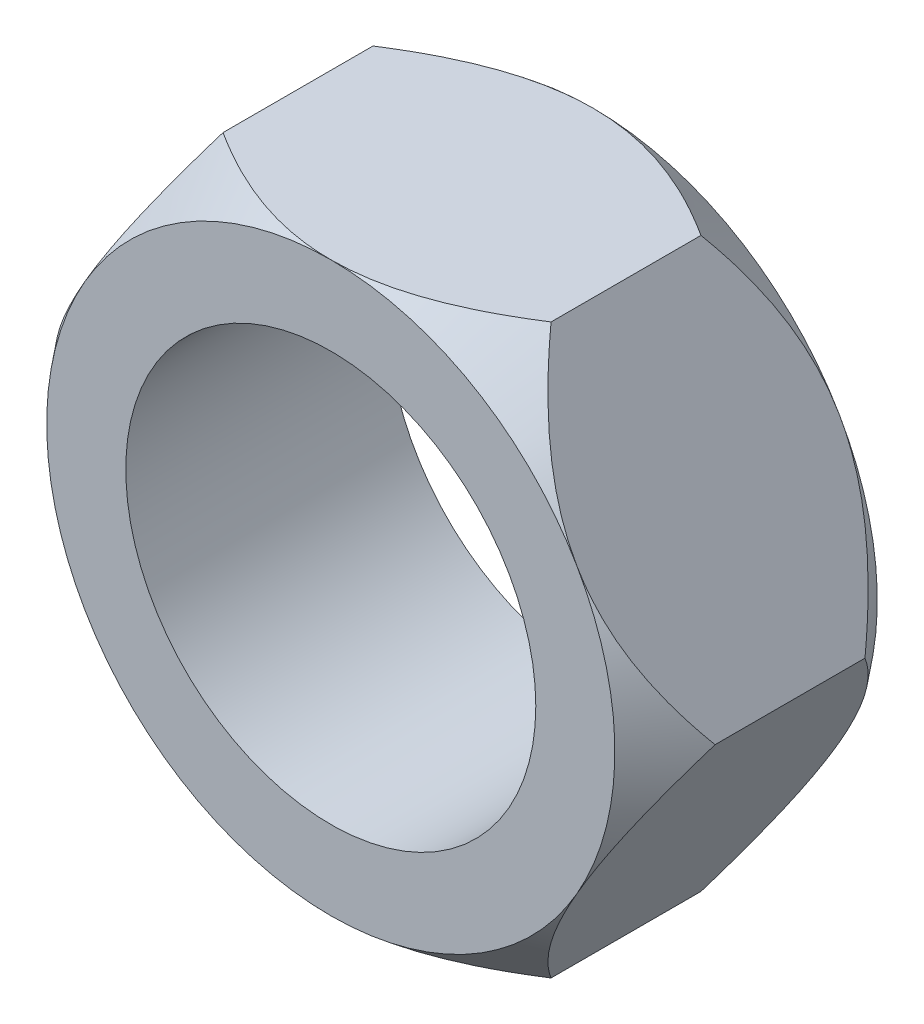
ISO-10303-21;
HEADER;
FILE_DESCRIPTION(('STEP AP214'),'2;1');
FILE_NAME('part.step','',(''),(''),'','','');
FILE_SCHEMA(('AUTOMOTIVE_DESIGN { 1 0 10303 214 1 1 1 1 }'));
ENDSEC;
DATA;
#1=APPLICATION_CONTEXT('core data for automotive mechanical design processes');
#2=APPLICATION_PROTOCOL_DEFINITION('international standard','automotive_design',2000,#1);
#3=PRODUCT_CONTEXT('',#1,'mechanical');
#4=PRODUCT('Part','Part','',(#3));
#5=PRODUCT_RELATED_PRODUCT_CATEGORY('part','',(#4));
#6=PRODUCT_DEFINITION_FORMATION('','',#4);
#7=PRODUCT_DEFINITION_CONTEXT('part definition',#1,'design');
#8=PRODUCT_DEFINITION('design','',#6,#7);
#9=PRODUCT_DEFINITION_SHAPE('','',#8);
#10=(LENGTH_UNIT() NAMED_UNIT(*) SI_UNIT(.MILLI.,.METRE.));
#11=(NAMED_UNIT(*) PLANE_ANGLE_UNIT() SI_UNIT($,.RADIAN.));
#12=(NAMED_UNIT(*) SI_UNIT($,.STERADIAN.) SOLID_ANGLE_UNIT());
#13=UNCERTAINTY_MEASURE_WITH_UNIT(LENGTH_MEASURE(1.E-05),#10,'distance_accuracy_value','');
#14=(GEOMETRIC_REPRESENTATION_CONTEXT(3) GLOBAL_UNCERTAINTY_ASSIGNED_CONTEXT((#13)) GLOBAL_UNIT_ASSIGNED_CONTEXT((#10,
#11,#12)) REPRESENTATION_CONTEXT('',''));
#15=CARTESIAN_POINT('',(0.,0.,0.));
#16=DIRECTION('',(0.,0.,1.));
#17=DIRECTION('',(1.,0.,0.));
#18=AXIS2_PLACEMENT_3D('',#15,#16,#17);
#19=CARTESIAN_POINT('',(0.,0.,-2.032));
#20=DIRECTION('',(0.,0.,1.));
#21=DIRECTION('',(1.,0.,0.));
#22=AXIS2_PLACEMENT_3D('',#19,#20,#21);
#23=PLANE('',#22);
#24=CARTESIAN_POINT('',(0.,0.,-2.032));
#25=DIRECTION('',(0.,0.,1.));
#26=DIRECTION('',(1.,0.,0.));
#27=AXIS2_PLACEMENT_3D('',#24,#25,#26);
#28=CIRCLE('',#27,3.175);
#29=CARTESIAN_POINT('',(3.175,0.,-2.032));
#30=VERTEX_POINT('',#29);
#31=EDGE_CURVE('E270',#30,#30,#28,.T.);
#32=ORIENTED_EDGE('',*,*,#31,.T.);
#33=EDGE_LOOP('',(#32));
#34=FACE_BOUND('',#33,.T.);
#35=CARTESIAN_POINT('',(0.,0.,-2.032));
#36=DIRECTION('',(0.,0.,1.));
#37=DIRECTION('',(1.,0.,0.));
#38=AXIS2_PLACEMENT_3D('',#35,#36,#37);
#39=CIRCLE('',#38,4.39940905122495);
#40=CARTESIAN_POINT('',(3.81,2.19970452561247,-2.032));
#41=VERTEX_POINT('',#40);
#42=CARTESIAN_POINT('',(3.81,-2.19970452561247,-2.032));
#43=VERTEX_POINT('',#42);
#44=EDGE_CURVE('E48',#41,#43,#39,.F.);
#45=ORIENTED_EDGE('',*,*,#44,.T.);
#46=CARTESIAN_POINT('',(0.,-4.39940905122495,-2.032));
#47=VERTEX_POINT('',#46);
#48=EDGE_CURVE('E12',#43,#47,#39,.F.);
#49=ORIENTED_EDGE('',*,*,#48,.T.);
#50=CARTESIAN_POINT('',(-3.81,-2.19970452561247,-2.032));
#51=VERTEX_POINT('',#50);
#52=EDGE_CURVE('E54',#47,#51,#39,.F.);
#53=ORIENTED_EDGE('',*,*,#52,.T.);
#54=CARTESIAN_POINT('',(-3.81,2.19970452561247,-2.032));
#55=VERTEX_POINT('',#54);
#56=EDGE_CURVE('E384',#51,#55,#39,.F.);
#57=ORIENTED_EDGE('',*,*,#56,.T.);
#58=CARTESIAN_POINT('',(0.,4.39940905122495,-2.032));
#59=VERTEX_POINT('',#58);
#60=EDGE_CURVE('E152',#55,#59,#39,.F.);
#61=ORIENTED_EDGE('',*,*,#60,.T.);
#62=CARTESIAN_POINT('',(0.,0.,-2.032));
#63=DIRECTION('',(0.,0.,1.));
#64=DIRECTION('',(1.,0.,0.));
#65=AXIS2_PLACEMENT_3D('',#62,#63,#64);
#66=CIRCLE('',#65,4.39940905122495);
#67=EDGE_CURVE('E137',#41,#59,#66,.T.);
#68=ORIENTED_EDGE('',*,*,#67,.F.);
#69=EDGE_LOOP('',(#45,#49,#53,#57,#61,#68));
#70=FACE_BOUND('',#69,.T.);
#71=ADVANCED_FACE('F43',(#34,#70),#23,.F.);
#72=CARTESIAN_POINT('',(0.,0.,2.032));
#73=DIRECTION('',(0.,0.,1.));
#74=DIRECTION('',(1.,0.,0.));
#75=AXIS2_PLACEMENT_3D('',#72,#73,#74);
#76=PLANE('',#75);
#77=CARTESIAN_POINT('',(0.,0.,2.032));
#78=DIRECTION('',(0.,0.,1.));
#79=DIRECTION('',(1.,0.,0.));
#80=AXIS2_PLACEMENT_3D('',#77,#78,#79);
#81=CIRCLE('',#80,3.175);
#82=CARTESIAN_POINT('',(3.175,0.,2.032));
#83=VERTEX_POINT('',#82);
#84=EDGE_CURVE('E266',#83,#83,#81,.T.);
#85=ORIENTED_EDGE('',*,*,#84,.F.);
#86=EDGE_LOOP('',(#85));
#87=FACE_BOUND('',#86,.T.);
#88=CARTESIAN_POINT('',(0.,0.,2.032));
#89=DIRECTION('',(0.,0.,1.));
#90=DIRECTION('',(1.,0.,0.));
#91=AXIS2_PLACEMENT_3D('',#88,#89,#90);
#92=CIRCLE('',#91,4.39940905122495);
#93=CARTESIAN_POINT('',(3.81,-2.19970452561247,2.032));
#94=VERTEX_POINT('',#93);
#95=CARTESIAN_POINT('',(3.81,2.19970452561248,2.032));
#96=VERTEX_POINT('',#95);
#97=EDGE_CURVE('E163',#94,#96,#92,.T.);
#98=ORIENTED_EDGE('',*,*,#97,.T.);
#99=CARTESIAN_POINT('',(0.,4.39940905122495,2.032));
#100=VERTEX_POINT('',#99);
#101=EDGE_CURVE('E168',#96,#100,#92,.T.);
#102=ORIENTED_EDGE('',*,*,#101,.T.);
#103=CARTESIAN_POINT('',(-3.81,2.19970452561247,2.032));
#104=VERTEX_POINT('',#103);
#105=EDGE_CURVE('E327',#100,#104,#92,.T.);
#106=ORIENTED_EDGE('',*,*,#105,.T.);
#107=CARTESIAN_POINT('',(-3.81,-2.19970452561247,2.032));
#108=VERTEX_POINT('',#107);
#109=EDGE_CURVE('E332',#104,#108,#92,.T.);
#110=ORIENTED_EDGE('',*,*,#109,.T.);
#111=CARTESIAN_POINT('',(0.,-4.39940905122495,2.032));
#112=VERTEX_POINT('',#111);
#113=EDGE_CURVE('E335',#108,#112,#92,.T.);
#114=ORIENTED_EDGE('',*,*,#113,.T.);
#115=EDGE_CURVE('E166',#112,#94,#92,.T.);
#116=ORIENTED_EDGE('',*,*,#115,.T.);
#117=EDGE_LOOP('',(#98,#102,#106,#110,#114,#116));
#118=FACE_BOUND('',#117,.T.);
#119=ADVANCED_FACE('F340',(#87,#118),#76,.T.);
#120=CARTESIAN_POINT('',(5.08,0.,2.032));
#121=DIRECTION('',(-0.866025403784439,-0.5,0.));
#122=DIRECTION('',(0.5,-0.866025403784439,0.));
#123=AXIS2_PLACEMENT_3D('',#120,#121,#122);
#124=PLANE('',#123);
#125=DIRECTION('',(0.,0.,-1.));
#126=VECTOR('',#125,1.);
#127=CARTESIAN_POINT('',(5.08,0.,2.032));
#128=LINE('',#127,#126);
#129=CARTESIAN_POINT('',(5.08,0.,1.16088331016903));
#130=VERTEX_POINT('',#129);
#131=CARTESIAN_POINT('',(5.08,0.,-1.16088331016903));
#132=VERTEX_POINT('',#131);
#133=EDGE_CURVE('E161',#130,#132,#128,.T.);
#134=ORIENTED_EDGE('',*,*,#133,.T.);
#135=CARTESIAN_POINT('',(5.08011547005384,-0.000199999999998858,-1.16073551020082));
#136=CARTESIAN_POINT('',(5.04480692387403,0.0609561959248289,-1.20592488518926));
#137=CARTESIAN_POINT('',(5.00918112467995,0.122661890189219,-1.25012049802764));
#138=CARTESIAN_POINT('',(4.93722581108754,0.247292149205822,-1.33622960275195));
#139=CARTESIAN_POINT('',(4.90089598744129,0.310217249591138,-1.37814205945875));
#140=CARTESIAN_POINT('',(4.79033661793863,0.501711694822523,-1.50045925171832));
#141=CARTESIAN_POINT('',(4.71497661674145,0.632239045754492,-1.57687155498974));
#142=CARTESIAN_POINT('',(4.56036233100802,0.900038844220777,-1.71630367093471));
#143=CARTESIAN_POINT('',(4.48107924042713,1.03736118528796,-1.77919756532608));
#144=CARTESIAN_POINT('',(4.31956082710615,1.31711928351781,-1.88631507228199));
#145=CARTESIAN_POINT('',(4.23733440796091,1.45953961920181,-1.93059055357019));
#146=CARTESIAN_POINT('',(4.10319979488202,1.69186758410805,-1.98365763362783));
#147=CARTESIAN_POINT('',(4.05198427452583,1.78057546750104,-1.99955392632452));
#148=CARTESIAN_POINT('',(3.94903311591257,1.95889210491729,-2.02228872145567));
#149=CARTESIAN_POINT('',(3.89729739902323,2.04850099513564,-2.02912583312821));
#150=CARTESIAN_POINT('',(3.79410025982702,2.22724368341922,-2.03339122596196));
#151=CARTESIAN_POINT('',(3.74263952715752,2.31637628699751,-2.03088655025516));
#152=CARTESIAN_POINT('',(3.64003830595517,2.49408681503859,-2.01673937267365));
#153=CARTESIAN_POINT('',(3.58889780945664,2.58266475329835,-2.00509709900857));
#154=CARTESIAN_POINT('',(3.48757804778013,2.75815572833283,-1.97328085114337));
#155=CARTESIAN_POINT('',(3.43739505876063,2.84507521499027,-1.9531538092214));
#156=CARTESIAN_POINT('',(3.33795412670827,3.01731196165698,-1.90516133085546));
#157=CARTESIAN_POINT('',(3.28869661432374,3.10262847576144,-1.87729238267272));
#158=CARTESIAN_POINT('',(3.14204196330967,3.35664178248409,-1.78311768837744));
#159=CARTESIAN_POINT('',(3.04629641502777,3.52247793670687,-1.70642859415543));
#160=CARTESIAN_POINT('',(2.88108494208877,3.80863260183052,-1.55291452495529));
#161=CARTESIAN_POINT('',(2.81063094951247,3.93066249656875,-1.48016029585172));
#162=CARTESIAN_POINT('',(2.70726198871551,4.10970278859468,-1.36453579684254));
#163=CARTESIAN_POINT('',(2.67336650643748,4.16841148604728,-1.32514015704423));
#164=CARTESIAN_POINT('',(2.60618201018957,4.28477844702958,-1.2443638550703));
#165=CARTESIAN_POINT('',(2.57289285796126,4.3424369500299,-1.20298365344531));
#166=CARTESIAN_POINT('',(2.53988452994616,4.39960905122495,-1.16073551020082));
#167=B_SPLINE_CURVE_WITH_KNOTS('',3,(#135,#136,#137,#138,#139,#140,#141,#142,#143,#144,#145,
#146,#147,#148,#149,#150,#151,#152,#153,#154,#155,#156,#157,#158,#159,#160,#161,#162,#163,#164,
#165,#166),.UNSPECIFIED.,.F.,.F.,(4,2,2,2,2,2,2,2,2,2,2,2,2,2,2,4),(0.,0.251498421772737,
0.503109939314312,1.00947295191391,1.52036567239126,2.02982552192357,2.34044334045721,
2.65110883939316,2.95954909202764,3.26798164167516,3.57473007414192,3.88161787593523,
4.4986118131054,4.97399992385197,5.20918753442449,5.44432082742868),.UNSPECIFIED.);
#168=EDGE_CURVE('E66',#132,#41,#167,.T.);
#169=ORIENTED_EDGE('',*,*,#168,.T.);
#170=CARTESIAN_POINT('',(2.54,4.39940905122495,-1.16088331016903));
#171=VERTEX_POINT('',#170);
#172=EDGE_CURVE('E134',#41,#171,#167,.T.);
#173=ORIENTED_EDGE('',*,*,#172,.T.);
#174=DIRECTION('',(0.,0.,-1.));
#175=VECTOR('',#174,1.);
#176=CARTESIAN_POINT('',(2.54,4.39940905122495,2.032));
#177=LINE('',#176,#175);
#178=CARTESIAN_POINT('',(2.54,4.39940905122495,1.16088331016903));
#179=VERTEX_POINT('',#178);
#180=EDGE_CURVE('E292',#179,#171,#177,.T.);
#181=ORIENTED_EDGE('',*,*,#180,.F.);
#182=CARTESIAN_POINT('',(5.08011547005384,-0.000199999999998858,1.16073551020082));
#183=CARTESIAN_POINT('',(5.04480692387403,0.0609561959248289,1.20592488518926));
#184=CARTESIAN_POINT('',(5.00918112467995,0.122661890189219,1.25012049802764));
#185=CARTESIAN_POINT('',(4.93722581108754,0.247292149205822,1.33622960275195));
#186=CARTESIAN_POINT('',(4.90089598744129,0.310217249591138,1.37814205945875));
#187=CARTESIAN_POINT('',(4.79033661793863,0.501711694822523,1.50045925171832));
#188=CARTESIAN_POINT('',(4.71497661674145,0.632239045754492,1.57687155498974));
#189=CARTESIAN_POINT('',(4.56036233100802,0.900038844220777,1.71630367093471));
#190=CARTESIAN_POINT('',(4.48107924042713,1.03736118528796,1.77919756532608));
#191=CARTESIAN_POINT('',(4.31956082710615,1.31711928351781,1.88631507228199));
#192=CARTESIAN_POINT('',(4.23733440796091,1.45953961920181,1.93059055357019));
#193=CARTESIAN_POINT('',(4.10319979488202,1.69186758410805,1.98365763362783));
#194=CARTESIAN_POINT('',(4.05198427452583,1.78057546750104,1.99955392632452));
#195=CARTESIAN_POINT('',(3.94903311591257,1.95889210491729,2.02228872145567));
#196=CARTESIAN_POINT('',(3.89729739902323,2.04850099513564,2.02912583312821));
#197=CARTESIAN_POINT('',(3.79410025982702,2.22724368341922,2.03339122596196));
#198=CARTESIAN_POINT('',(3.74263952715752,2.31637628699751,2.03088655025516));
#199=CARTESIAN_POINT('',(3.64003830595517,2.49408681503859,2.01673937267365));
#200=CARTESIAN_POINT('',(3.58889780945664,2.58266475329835,2.00509709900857));
#201=CARTESIAN_POINT('',(3.48757804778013,2.75815572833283,1.97328085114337));
#202=CARTESIAN_POINT('',(3.43739505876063,2.84507521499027,1.9531538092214));
#203=CARTESIAN_POINT('',(3.33795412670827,3.01731196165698,1.90516133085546));
#204=CARTESIAN_POINT('',(3.28869661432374,3.10262847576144,1.87729238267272));
#205=CARTESIAN_POINT('',(3.14204196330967,3.35664178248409,1.78311768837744));
#206=CARTESIAN_POINT('',(3.04629641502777,3.52247793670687,1.70642859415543));
#207=CARTESIAN_POINT('',(2.88108494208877,3.80863260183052,1.55291452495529));
#208=CARTESIAN_POINT('',(2.81063094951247,3.93066249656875,1.48016029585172));
#209=CARTESIAN_POINT('',(2.70726198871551,4.10970278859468,1.36453579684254));
#210=CARTESIAN_POINT('',(2.67336650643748,4.16841148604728,1.32514015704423));
#211=CARTESIAN_POINT('',(2.60618201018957,4.28477844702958,1.2443638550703));
#212=CARTESIAN_POINT('',(2.57289285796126,4.3424369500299,1.20298365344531));
#213=CARTESIAN_POINT('',(2.53988452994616,4.39960905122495,1.16073551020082));
#214=B_SPLINE_CURVE_WITH_KNOTS('',3,(#182,#183,#184,#185,#186,#187,#188,#189,#190,#191,#192,
#193,#194,#195,#196,#197,#198,#199,#200,#201,#202,#203,#204,#205,#206,#207,#208,#209,#210,#211,
#212,#213),.UNSPECIFIED.,.F.,.F.,(4,2,2,2,2,2,2,2,2,2,2,2,2,2,2,4),(0.,0.251498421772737,
0.503109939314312,1.00947295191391,1.52036567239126,2.02982552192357,2.34044334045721,
2.65110883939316,2.95954909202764,3.26798164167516,3.57473007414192,3.88161787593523,
4.4986118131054,4.97399992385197,5.20918753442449,5.44432082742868),.UNSPECIFIED.);
#215=EDGE_CURVE('E258',#96,#179,#214,.T.);
#216=ORIENTED_EDGE('',*,*,#215,.F.);
#217=EDGE_CURVE('E265',#130,#96,#214,.T.);
#218=ORIENTED_EDGE('',*,*,#217,.F.);
#219=EDGE_LOOP('',(#134,#169,#173,#181,#216,#218));
#220=FACE_BOUND('',#219,.T.);
#221=ADVANCED_FACE('F45',(#220),#124,.F.);
#222=CARTESIAN_POINT('',(2.54,4.39940905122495,2.032));
#223=DIRECTION('',(0.,-1.,0.));
#224=DIRECTION('',(1.,0.,0.));
#225=AXIS2_PLACEMENT_3D('',#222,#223,#224);
#226=PLANE('',#225);
#227=ORIENTED_EDGE('',*,*,#180,.T.);
#228=CARTESIAN_POINT('',(-5.45249556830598,4.39940905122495,1.30432738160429));
#229=CARTESIAN_POINT('',(-5.32955836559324,4.39940905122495,1.18189343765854));
#230=CARTESIAN_POINT('',(-5.20582468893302,4.39940905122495,1.06024761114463));
#231=CARTESIAN_POINT('',(-4.95642072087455,4.39940905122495,0.818900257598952));
#232=CARTESIAN_POINT('',(-4.83074997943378,4.39940905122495,0.699199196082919));
#233=CARTESIAN_POINT('',(-4.57608157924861,4.39940905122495,0.461135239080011));
#234=CARTESIAN_POINT('',(-4.44706447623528,4.39940905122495,0.342793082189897));
#235=CARTESIAN_POINT('',(-4.18636613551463,4.39940905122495,0.109094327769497));
#236=CARTESIAN_POINT('',(-4.05468511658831,4.39940905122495,-0.00626251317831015));
#237=CARTESIAN_POINT('',(-3.77952793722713,4.39940905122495,-0.240605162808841));
#238=CARTESIAN_POINT('',(-3.63583973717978,4.39940905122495,-0.359343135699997));
#239=CARTESIAN_POINT('',(-3.34408843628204,4.39940905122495,-0.591421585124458));
#240=CARTESIAN_POINT('',(-3.19602435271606,4.39940905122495,-0.704760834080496));
#241=CARTESIAN_POINT('',(-2.89520871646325,4.39940905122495,-0.923904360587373));
#242=CARTESIAN_POINT('',(-2.74247612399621,4.39940905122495,-1.02973448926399));
#243=CARTESIAN_POINT('',(-2.4308747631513,4.39940905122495,-1.23188049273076));
#244=CARTESIAN_POINT('',(-2.27200970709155,4.39940905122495,-1.32820200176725));
#245=CARTESIAN_POINT('',(-1.99738267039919,4.39940905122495,-1.48017574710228));
#246=CARTESIAN_POINT('',(-1.88348890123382,4.39940905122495,-1.53919158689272));
#247=CARTESIAN_POINT('',(-1.65201186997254,4.39940905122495,-1.6496572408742));
#248=CARTESIAN_POINT('',(-1.53442763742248,4.39940905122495,-1.7011050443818));
#249=CARTESIAN_POINT('',(-1.29682608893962,4.39940905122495,-1.7942193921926));
#250=CARTESIAN_POINT('',(-1.17684705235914,4.39940905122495,-1.83598255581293));
#251=CARTESIAN_POINT('',(-0.933639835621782,4.39940905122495,-1.90858045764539));
#252=CARTESIAN_POINT('',(-0.810413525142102,4.39940905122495,-1.93942134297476));
#253=CARTESIAN_POINT('',(-0.5862731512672,4.39940905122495,-1.98362009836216));
#254=CARTESIAN_POINT('',(-0.485804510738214,4.39940905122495,-1.99923686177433));
#255=CARTESIAN_POINT('',(-0.283893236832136,4.39940905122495,-2.02175528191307));
#256=CARTESIAN_POINT('',(-0.182450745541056,4.39940905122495,-2.02865819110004));
#257=CARTESIAN_POINT('',(0.0206773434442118,4.39940905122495,-2.03343848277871));
#258=CARTESIAN_POINT('',(0.122363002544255,4.39940905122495,-2.03131327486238));
#259=CARTESIAN_POINT('',(0.325153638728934,4.39940905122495,-2.01812966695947));
#260=CARTESIAN_POINT('',(0.4262585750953,4.39940905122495,-2.00707064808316));
#261=CARTESIAN_POINT('',(0.626523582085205,4.39940905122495,-1.97660140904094));
#262=CARTESIAN_POINT('',(0.725691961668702,4.39940905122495,-1.95724512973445));
#263=CARTESIAN_POINT('',(0.922243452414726,4.39940905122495,-1.91093496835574));
#264=CARTESIAN_POINT('',(1.01962614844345,4.39940905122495,-1.88397934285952));
#265=CARTESIAN_POINT('',(1.21238714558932,4.39940905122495,-1.8233186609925));
#266=CARTESIAN_POINT('',(1.30776265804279,4.39940905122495,-1.78960482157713));
#267=CARTESIAN_POINT('',(1.49623298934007,4.39940905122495,-1.71635960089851));
#268=CARTESIAN_POINT('',(1.5893277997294,4.39940905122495,-1.67682819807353));
#269=CARTESIAN_POINT('',(1.80260240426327,4.39940905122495,-1.57938170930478));
#270=CARTESIAN_POINT('',(1.92193955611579,4.39940905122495,-1.5196269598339));
#271=CARTESIAN_POINT('',(2.15688795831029,4.39940905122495,-1.39315397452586));
#272=CARTESIAN_POINT('',(2.27249757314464,4.39940905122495,-1.32643273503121));
#273=CARTESIAN_POINT('',(2.50047430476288,4.39940905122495,-1.18730208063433));
#274=CARTESIAN_POINT('',(2.61283594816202,4.39940905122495,-1.1148837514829));
#275=CARTESIAN_POINT('',(2.83451785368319,4.39940905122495,-0.965526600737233));
#276=CARTESIAN_POINT('',(2.94383770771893,4.39940905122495,-0.888587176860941));
#277=CARTESIAN_POINT('',(3.16133804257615,4.39940905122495,-0.729912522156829));
#278=CARTESIAN_POINT('',(3.26947976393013,4.39940905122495,-0.648124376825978));
#279=CARTESIAN_POINT('',(3.48335230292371,4.39940905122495,-0.481459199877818));
#280=CARTESIAN_POINT('',(3.58908305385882,4.39940905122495,-0.396582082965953));
#281=CARTESIAN_POINT('',(3.79833039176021,4.39940905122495,-0.22436734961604));
#282=CARTESIAN_POINT('',(3.9018491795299,4.39940905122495,-0.137032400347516));
#283=CARTESIAN_POINT('',(4.107046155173,4.39940905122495,0.0397613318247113));
#284=CARTESIAN_POINT('',(4.20872440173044,4.39940905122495,0.129220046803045));
#285=CARTESIAN_POINT('',(4.51101855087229,4.39940905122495,0.399966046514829));
#286=CARTESIAN_POINT('',(4.70924821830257,4.39940905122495,0.583918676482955));
#287=CARTESIAN_POINT('',(5.10078851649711,4.39940905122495,0.957000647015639));
#288=CARTESIAN_POINT('',(5.2940984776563,4.39940905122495,1.14613068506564));
#289=CARTESIAN_POINT('',(5.67690632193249,4.39940905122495,1.52836004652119));
#290=CARTESIAN_POINT('',(5.86640256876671,4.39940905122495,1.72146100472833));
#291=CARTESIAN_POINT('',(6.24228732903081,4.39940905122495,2.11066961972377));
#292=CARTESIAN_POINT('',(6.428675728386,4.39940905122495,2.30677738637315));
#293=CARTESIAN_POINT('',(6.79935360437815,4.39940905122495,2.70181026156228));
#294=CARTESIAN_POINT('',(6.98363727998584,4.39940905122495,2.90074080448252));
#295=CARTESIAN_POINT('',(7.35012176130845,4.39940905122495,3.30051307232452));
#296=CARTESIAN_POINT('',(7.53232253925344,4.39940905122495,3.50135482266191));
#297=CARTESIAN_POINT('',(8.0762513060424,4.39940905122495,4.1060875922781));
#298=CARTESIAN_POINT('',(8.43540542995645,4.39940905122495,4.51229325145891));
#299=CARTESIAN_POINT('',(9.11159433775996,4.39940905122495,5.28630877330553));
#300=CARTESIAN_POINT('',(9.42911140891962,4.39940905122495,5.65369917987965));
#301=CARTESIAN_POINT('',(10.0611871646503,4.39940905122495,6.39106242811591));
#302=CARTESIAN_POINT('',(10.3757456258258,4.39940905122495,6.76103546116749));
#303=CARTESIAN_POINT('',(11.0011486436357,4.39940905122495,7.50126653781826));
#304=CARTESIAN_POINT('',(11.3120035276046,4.39940905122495,7.87151586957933));
#305=CARTESIAN_POINT('',(11.9318412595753,4.39940905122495,8.61351563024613));
#306=CARTESIAN_POINT('',(12.2408242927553,4.39940905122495,8.98526590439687));
#307=CARTESIAN_POINT('',(12.5491107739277,4.39940905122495,9.3575893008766));
#308=B_SPLINE_CURVE_WITH_KNOTS('',3,(#228,#229,#230,#231,#232,#233,#234,#235,#236,#237,#238,
#239,#240,#241,#242,#243,#244,#245,#246,#247,#248,#249,#250,#251,#252,#253,#254,#255,#256,#257,
#258,#259,#260,#261,#262,#263,#264,#265,#266,#267,#268,#269,#270,#271,#272,#273,#274,#275,#276,
#277,#278,#279,#280,#281,#282,#283,#284,#285,#286,#287,#288,#289,#290,#291,#292,#293,#294,#295,
#296,#297,#298,#299,#300,#301,#302,#303,#304,#305,#306,#307),.UNSPECIFIED.,.F.,.F.,(4,2,2,2,2,2,
2,2,2,2,2,2,2,2,2,2,2,2,2,2,2,2,2,2,2,2,2,2,2,2,2,2,2,2,2,2,2,2,2,4),(0.,0.520520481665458,
1.04116377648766,1.56634220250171,2.09147767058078,2.65057712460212,3.2098031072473,
3.76699971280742,4.32386414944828,4.70847093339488,5.09317971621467,5.47386725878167,
5.85434020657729,6.15901834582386,6.46365268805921,6.76837444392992,7.07311731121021,
7.37590838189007,7.67876897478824,7.98202575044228,8.28528365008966,8.68536832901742,
9.08562622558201,9.486523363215,9.88747402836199,10.2941687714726,10.7008747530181,
11.1071552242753,11.5134227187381,12.324574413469,13.1358359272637,13.9474383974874,
14.7590705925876,15.5725661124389,16.3860724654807,18.0126462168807,19.4693848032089,
20.9262325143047,22.3765497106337,23.8267210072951),.UNSPECIFIED.);
#309=EDGE_CURVE('E140',#171,#59,#308,.F.);
#310=ORIENTED_EDGE('',*,*,#309,.T.);
#311=CARTESIAN_POINT('',(-2.54,4.39940905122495,-1.16088331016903));
#312=VERTEX_POINT('',#311);
#313=EDGE_CURVE('E175',#59,#312,#308,.F.);
#314=ORIENTED_EDGE('',*,*,#313,.T.);
#315=DIRECTION('',(0.,0.,-1.));
#316=VECTOR('',#315,1.);
#317=CARTESIAN_POINT('',(-2.54,4.39940905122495,2.032));
#318=LINE('',#317,#316);
#319=CARTESIAN_POINT('',(-2.54,4.39940905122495,1.16088331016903));
#320=VERTEX_POINT('',#319);
#321=EDGE_CURVE('E288',#320,#312,#318,.T.);
#322=ORIENTED_EDGE('',*,*,#321,.F.);
#323=CARTESIAN_POINT('',(-5.45249556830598,4.39940905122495,-1.30432738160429));
#324=CARTESIAN_POINT('',(-5.32955836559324,4.39940905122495,-1.18189343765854));
#325=CARTESIAN_POINT('',(-5.20582468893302,4.39940905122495,-1.06024761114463));
#326=CARTESIAN_POINT('',(-4.95642072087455,4.39940905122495,-0.818900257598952));
#327=CARTESIAN_POINT('',(-4.83074997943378,4.39940905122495,-0.699199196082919));
#328=CARTESIAN_POINT('',(-4.57608157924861,4.39940905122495,-0.461135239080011));
#329=CARTESIAN_POINT('',(-4.44706447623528,4.39940905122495,-0.342793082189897));
#330=CARTESIAN_POINT('',(-4.18636613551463,4.39940905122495,-0.109094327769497));
#331=CARTESIAN_POINT('',(-4.05468511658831,4.39940905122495,0.00626251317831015));
#332=CARTESIAN_POINT('',(-3.77952793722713,4.39940905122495,0.240605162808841));
#333=CARTESIAN_POINT('',(-3.63583973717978,4.39940905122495,0.359343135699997));
#334=CARTESIAN_POINT('',(-3.34408843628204,4.39940905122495,0.591421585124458));
#335=CARTESIAN_POINT('',(-3.19602435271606,4.39940905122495,0.704760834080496));
#336=CARTESIAN_POINT('',(-2.89520871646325,4.39940905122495,0.923904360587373));
#337=CARTESIAN_POINT('',(-2.74247612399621,4.39940905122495,1.02973448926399));
#338=CARTESIAN_POINT('',(-2.4308747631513,4.39940905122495,1.23188049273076));
#339=CARTESIAN_POINT('',(-2.27200970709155,4.39940905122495,1.32820200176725));
#340=CARTESIAN_POINT('',(-1.99738267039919,4.39940905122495,1.48017574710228));
#341=CARTESIAN_POINT('',(-1.88348890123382,4.39940905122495,1.53919158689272));
#342=CARTESIAN_POINT('',(-1.65201186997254,4.39940905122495,1.6496572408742));
#343=CARTESIAN_POINT('',(-1.53442763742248,4.39940905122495,1.7011050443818));
#344=CARTESIAN_POINT('',(-1.29682608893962,4.39940905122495,1.7942193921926));
#345=CARTESIAN_POINT('',(-1.17684705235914,4.39940905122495,1.83598255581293));
#346=CARTESIAN_POINT('',(-0.933639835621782,4.39940905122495,1.90858045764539));
#347=CARTESIAN_POINT('',(-0.810413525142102,4.39940905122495,1.93942134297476));
#348=CARTESIAN_POINT('',(-0.5862731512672,4.39940905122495,1.98362009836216));
#349=CARTESIAN_POINT('',(-0.485804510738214,4.39940905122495,1.99923686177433));
#350=CARTESIAN_POINT('',(-0.283893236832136,4.39940905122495,2.02175528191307));
#351=CARTESIAN_POINT('',(-0.182450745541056,4.39940905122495,2.02865819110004));
#352=CARTESIAN_POINT('',(0.0206773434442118,4.39940905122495,2.03343848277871));
#353=CARTESIAN_POINT('',(0.122363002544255,4.39940905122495,2.03131327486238));
#354=CARTESIAN_POINT('',(0.325153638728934,4.39940905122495,2.01812966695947));
#355=CARTESIAN_POINT('',(0.4262585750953,4.39940905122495,2.00707064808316));
#356=CARTESIAN_POINT('',(0.626523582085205,4.39940905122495,1.97660140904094));
#357=CARTESIAN_POINT('',(0.725691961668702,4.39940905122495,1.95724512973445));
#358=CARTESIAN_POINT('',(0.922243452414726,4.39940905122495,1.91093496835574));
#359=CARTESIAN_POINT('',(1.01962614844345,4.39940905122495,1.88397934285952));
#360=CARTESIAN_POINT('',(1.21238714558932,4.39940905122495,1.8233186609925));
#361=CARTESIAN_POINT('',(1.30776265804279,4.39940905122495,1.78960482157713));
#362=CARTESIAN_POINT('',(1.49623298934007,4.39940905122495,1.71635960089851));
#363=CARTESIAN_POINT('',(1.5893277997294,4.39940905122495,1.67682819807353));
#364=CARTESIAN_POINT('',(1.80260240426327,4.39940905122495,1.57938170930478));
#365=CARTESIAN_POINT('',(1.92193955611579,4.39940905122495,1.5196269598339));
#366=CARTESIAN_POINT('',(2.15688795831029,4.39940905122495,1.39315397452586));
#367=CARTESIAN_POINT('',(2.27249757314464,4.39940905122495,1.32643273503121));
#368=CARTESIAN_POINT('',(2.50047430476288,4.39940905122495,1.18730208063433));
#369=CARTESIAN_POINT('',(2.61283594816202,4.39940905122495,1.1148837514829));
#370=CARTESIAN_POINT('',(2.83451785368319,4.39940905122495,0.965526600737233));
#371=CARTESIAN_POINT('',(2.94383770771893,4.39940905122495,0.888587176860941));
#372=CARTESIAN_POINT('',(3.16133804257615,4.39940905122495,0.729912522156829));
#373=CARTESIAN_POINT('',(3.26947976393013,4.39940905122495,0.648124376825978));
#374=CARTESIAN_POINT('',(3.48335230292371,4.39940905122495,0.481459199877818));
#375=CARTESIAN_POINT('',(3.58908305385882,4.39940905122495,0.396582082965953));
#376=CARTESIAN_POINT('',(3.79833039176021,4.39940905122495,0.22436734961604));
#377=CARTESIAN_POINT('',(3.9018491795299,4.39940905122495,0.137032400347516));
#378=CARTESIAN_POINT('',(4.107046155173,4.39940905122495,-0.0397613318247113));
#379=CARTESIAN_POINT('',(4.20872440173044,4.39940905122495,-0.129220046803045));
#380=CARTESIAN_POINT('',(4.51101855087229,4.39940905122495,-0.399966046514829));
#381=CARTESIAN_POINT('',(4.70924821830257,4.39940905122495,-0.583918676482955));
#382=CARTESIAN_POINT('',(5.10078851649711,4.39940905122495,-0.957000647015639));
#383=CARTESIAN_POINT('',(5.2940984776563,4.39940905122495,-1.14613068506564));
#384=CARTESIAN_POINT('',(5.67690632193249,4.39940905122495,-1.52836004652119));
#385=CARTESIAN_POINT('',(5.86640256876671,4.39940905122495,-1.72146100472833));
#386=CARTESIAN_POINT('',(6.24228732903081,4.39940905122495,-2.11066961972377));
#387=CARTESIAN_POINT('',(6.428675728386,4.39940905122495,-2.30677738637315));
#388=CARTESIAN_POINT('',(6.79935360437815,4.39940905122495,-2.70181026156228));
#389=CARTESIAN_POINT('',(6.98363727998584,4.39940905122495,-2.90074080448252));
#390=CARTESIAN_POINT('',(7.35012176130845,4.39940905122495,-3.30051307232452));
#391=CARTESIAN_POINT('',(7.53232253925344,4.39940905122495,-3.50135482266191));
#392=CARTESIAN_POINT('',(8.0762513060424,4.39940905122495,-4.1060875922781));
#393=CARTESIAN_POINT('',(8.43540542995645,4.39940905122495,-4.51229325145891));
#394=CARTESIAN_POINT('',(9.11159433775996,4.39940905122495,-5.28630877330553));
#395=CARTESIAN_POINT('',(9.42911140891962,4.39940905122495,-5.65369917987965));
#396=CARTESIAN_POINT('',(10.0611871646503,4.39940905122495,-6.39106242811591));
#397=CARTESIAN_POINT('',(10.3757456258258,4.39940905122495,-6.76103546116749));
#398=CARTESIAN_POINT('',(11.0011486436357,4.39940905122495,-7.50126653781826));
#399=CARTESIAN_POINT('',(11.3120035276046,4.39940905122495,-7.87151586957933));
#400=CARTESIAN_POINT('',(11.9318412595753,4.39940905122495,-8.61351563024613));
#401=CARTESIAN_POINT('',(12.2408242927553,4.39940905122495,-8.98526590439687));
#402=CARTESIAN_POINT('',(12.5491107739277,4.39940905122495,-9.3575893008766));
#403=B_SPLINE_CURVE_WITH_KNOTS('',3,(#323,#324,#325,#326,#327,#328,#329,#330,#331,#332,#333,
#334,#335,#336,#337,#338,#339,#340,#341,#342,#343,#344,#345,#346,#347,#348,#349,#350,#351,#352,
#353,#354,#355,#356,#357,#358,#359,#360,#361,#362,#363,#364,#365,#366,#367,#368,#369,#370,#371,
#372,#373,#374,#375,#376,#377,#378,#379,#380,#381,#382,#383,#384,#385,#386,#387,#388,#389,#390,
#391,#392,#393,#394,#395,#396,#397,#398,#399,#400,#401,#402),.UNSPECIFIED.,.F.,.F.,(4,2,2,2,2,2,
2,2,2,2,2,2,2,2,2,2,2,2,2,2,2,2,2,2,2,2,2,2,2,2,2,2,2,2,2,2,2,2,2,4),(0.,0.520520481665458,
1.04116377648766,1.56634220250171,2.09147767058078,2.65057712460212,3.2098031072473,
3.76699971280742,4.32386414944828,4.70847093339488,5.09317971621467,5.47386725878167,
5.85434020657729,6.15901834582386,6.46365268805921,6.76837444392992,7.07311731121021,
7.37590838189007,7.67876897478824,7.98202575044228,8.28528365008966,8.68536832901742,
9.08562622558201,9.486523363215,9.88747402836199,10.2941687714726,10.7008747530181,
11.1071552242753,11.5134227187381,12.324574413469,13.1358359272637,13.9474383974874,
14.7590705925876,15.5725661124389,16.3860724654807,18.0126462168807,19.4693848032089,
20.9262325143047,22.3765497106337,23.8267210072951),.UNSPECIFIED.);
#404=EDGE_CURVE('E250',#100,#320,#403,.F.);
#405=ORIENTED_EDGE('',*,*,#404,.F.);
#406=EDGE_CURVE('E257',#179,#100,#403,.F.);
#407=ORIENTED_EDGE('',*,*,#406,.F.);
#408=EDGE_LOOP('',(#227,#310,#314,#322,#405,#407));
#409=FACE_BOUND('',#408,.T.);
#410=ADVANCED_FACE('F229',(#409),#226,.F.);
#411=CARTESIAN_POINT('',(-2.54,4.39940905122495,2.032));
#412=DIRECTION('',(0.866025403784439,-0.5,0.));
#413=DIRECTION('',(0.5,0.866025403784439,0.));
#414=AXIS2_PLACEMENT_3D('',#411,#412,#413);
#415=PLANE('',#414);
#416=ORIENTED_EDGE('',*,*,#321,.T.);
#417=CARTESIAN_POINT('',(-2.53988452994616,4.39960905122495,-1.16073551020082));
#418=CARTESIAN_POINT('',(-2.57519307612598,4.33845285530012,-1.20592488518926));
#419=CARTESIAN_POINT('',(-2.61081887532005,4.27674716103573,-1.25012049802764));
#420=CARTESIAN_POINT('',(-2.68277418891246,4.15211690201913,-1.33622960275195));
#421=CARTESIAN_POINT('',(-2.71910401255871,4.08919180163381,-1.37814205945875));
#422=CARTESIAN_POINT('',(-2.82966338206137,3.89769735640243,-1.50045925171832));
#423=CARTESIAN_POINT('',(-2.90502338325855,3.76717000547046,-1.57687155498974));
#424=CARTESIAN_POINT('',(-3.05963766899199,3.49937020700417,-1.71630367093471));
#425=CARTESIAN_POINT('',(-3.13892075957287,3.36204786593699,-1.77919756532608));
#426=CARTESIAN_POINT('',(-3.30043917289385,3.08228976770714,-1.88631507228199));
#427=CARTESIAN_POINT('',(-3.38266559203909,2.93986943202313,-1.93059055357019));
#428=CARTESIAN_POINT('',(-3.51680020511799,2.7075414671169,-1.98365763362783));
#429=CARTESIAN_POINT('',(-3.56801572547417,2.61883358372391,-1.99955392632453));
#430=CARTESIAN_POINT('',(-3.67096688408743,2.44051694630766,-2.02228872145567));
#431=CARTESIAN_POINT('',(-3.72270260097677,2.35090805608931,-2.02912583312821));
#432=CARTESIAN_POINT('',(-3.82589974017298,2.17216536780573,-2.03339122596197));
#433=CARTESIAN_POINT('',(-3.87736047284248,2.08303276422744,-2.03088655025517));
#434=CARTESIAN_POINT('',(-3.97996169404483,1.90532223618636,-2.01673937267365));
#435=CARTESIAN_POINT('',(-4.03110219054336,1.81674429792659,-2.00509709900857));
#436=CARTESIAN_POINT('',(-4.13242195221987,1.64125332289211,-1.97328085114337));
#437=CARTESIAN_POINT('',(-4.18260494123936,1.55433383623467,-1.95315380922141));
#438=CARTESIAN_POINT('',(-4.28204587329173,1.38209708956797,-1.90516133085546));
#439=CARTESIAN_POINT('',(-4.33130338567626,1.29678057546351,-1.87729238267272));
#440=CARTESIAN_POINT('',(-4.47795803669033,1.04276726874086,-1.78311768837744));
#441=CARTESIAN_POINT('',(-4.57370358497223,0.876931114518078,-1.70642859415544));
#442=CARTESIAN_POINT('',(-4.73891505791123,0.59077644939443,-1.55291452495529));
#443=CARTESIAN_POINT('',(-4.80936905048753,0.468746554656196,-1.48016029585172));
#444=CARTESIAN_POINT('',(-4.91273801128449,0.289706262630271,-1.36453579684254));
#445=CARTESIAN_POINT('',(-4.94663349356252,0.23099756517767,-1.32514015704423));
#446=CARTESIAN_POINT('',(-5.01381798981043,0.114630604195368,-1.2443638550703));
#447=CARTESIAN_POINT('',(-5.04710714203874,0.0569721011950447,-1.20298365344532));
#448=CARTESIAN_POINT('',(-5.08011547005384,-0.000200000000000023,-1.16073551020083));
#449=B_SPLINE_CURVE_WITH_KNOTS('',3,(#417,#418,#419,#420,#421,#422,#423,#424,#425,#426,#427,
#428,#429,#430,#431,#432,#433,#434,#435,#436,#437,#438,#439,#440,#441,#442,#443,#444,#445,#446,
#447,#448),.UNSPECIFIED.,.F.,.F.,(4,2,2,2,2,2,2,2,2,2,2,2,2,2,2,4),(0.,0.251498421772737,
0.503109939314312,1.00947295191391,1.52036567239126,2.02982552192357,2.34044334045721,
2.65110883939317,2.95954909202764,3.26798164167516,3.57473007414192,3.88161787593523,
4.4986118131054,4.97399992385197,5.20918753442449,5.44432082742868),.UNSPECIFIED.);
#450=EDGE_CURVE('E223',#312,#55,#449,.T.);
#451=ORIENTED_EDGE('',*,*,#450,.T.);
#452=CARTESIAN_POINT('',(-5.08,0.,-1.16088331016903));
#453=VERTEX_POINT('',#452);
#454=EDGE_CURVE('E215',#55,#453,#449,.T.);
#455=ORIENTED_EDGE('',*,*,#454,.T.);
#456=DIRECTION('',(0.,0.,-1.));
#457=VECTOR('',#456,1.);
#458=CARTESIAN_POINT('',(-5.08,0.,2.032));
#459=LINE('',#458,#457);
#460=CARTESIAN_POINT('',(-5.08,0.,1.16088331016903));
#461=VERTEX_POINT('',#460);
#462=EDGE_CURVE('E284',#461,#453,#459,.T.);
#463=ORIENTED_EDGE('',*,*,#462,.F.);
#464=CARTESIAN_POINT('',(-2.53988452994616,4.39960905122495,1.16073551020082));
#465=CARTESIAN_POINT('',(-2.57519307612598,4.33845285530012,1.20592488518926));
#466=CARTESIAN_POINT('',(-2.61081887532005,4.27674716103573,1.25012049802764));
#467=CARTESIAN_POINT('',(-2.68277418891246,4.15211690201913,1.33622960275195));
#468=CARTESIAN_POINT('',(-2.71910401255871,4.08919180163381,1.37814205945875));
#469=CARTESIAN_POINT('',(-2.82966338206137,3.89769735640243,1.50045925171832));
#470=CARTESIAN_POINT('',(-2.90502338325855,3.76717000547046,1.57687155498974));
#471=CARTESIAN_POINT('',(-3.05963766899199,3.49937020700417,1.71630367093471));
#472=CARTESIAN_POINT('',(-3.13892075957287,3.36204786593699,1.77919756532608));
#473=CARTESIAN_POINT('',(-3.30043917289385,3.08228976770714,1.88631507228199));
#474=CARTESIAN_POINT('',(-3.38266559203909,2.93986943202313,1.93059055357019));
#475=CARTESIAN_POINT('',(-3.51680020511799,2.7075414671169,1.98365763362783));
#476=CARTESIAN_POINT('',(-3.56801572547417,2.61883358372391,1.99955392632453));
#477=CARTESIAN_POINT('',(-3.67096688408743,2.44051694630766,2.02228872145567));
#478=CARTESIAN_POINT('',(-3.72270260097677,2.35090805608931,2.02912583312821));
#479=CARTESIAN_POINT('',(-3.82589974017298,2.17216536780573,2.03339122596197));
#480=CARTESIAN_POINT('',(-3.87736047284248,2.08303276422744,2.03088655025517));
#481=CARTESIAN_POINT('',(-3.97996169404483,1.90532223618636,2.01673937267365));
#482=CARTESIAN_POINT('',(-4.03110219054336,1.81674429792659,2.00509709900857));
#483=CARTESIAN_POINT('',(-4.13242195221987,1.64125332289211,1.97328085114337));
#484=CARTESIAN_POINT('',(-4.18260494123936,1.55433383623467,1.95315380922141));
#485=CARTESIAN_POINT('',(-4.28204587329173,1.38209708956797,1.90516133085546));
#486=CARTESIAN_POINT('',(-4.33130338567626,1.29678057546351,1.87729238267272));
#487=CARTESIAN_POINT('',(-4.47795803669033,1.04276726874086,1.78311768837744));
#488=CARTESIAN_POINT('',(-4.57370358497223,0.876931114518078,1.70642859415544));
#489=CARTESIAN_POINT('',(-4.73891505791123,0.59077644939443,1.55291452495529));
#490=CARTESIAN_POINT('',(-4.80936905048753,0.468746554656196,1.48016029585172));
#491=CARTESIAN_POINT('',(-4.91273801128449,0.289706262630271,1.36453579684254));
#492=CARTESIAN_POINT('',(-4.94663349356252,0.23099756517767,1.32514015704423));
#493=CARTESIAN_POINT('',(-5.01381798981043,0.114630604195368,1.2443638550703));
#494=CARTESIAN_POINT('',(-5.04710714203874,0.0569721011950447,1.20298365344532));
#495=CARTESIAN_POINT('',(-5.08011547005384,-0.000200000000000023,1.16073551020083));
#496=B_SPLINE_CURVE_WITH_KNOTS('',3,(#464,#465,#466,#467,#468,#469,#470,#471,#472,#473,#474,
#475,#476,#477,#478,#479,#480,#481,#482,#483,#484,#485,#486,#487,#488,#489,#490,#491,#492,#493,
#494,#495),.UNSPECIFIED.,.F.,.F.,(4,2,2,2,2,2,2,2,2,2,2,2,2,2,2,4),(0.,0.251498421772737,
0.503109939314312,1.00947295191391,1.52036567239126,2.02982552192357,2.34044334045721,
2.65110883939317,2.95954909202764,3.26798164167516,3.57473007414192,3.88161787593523,
4.4986118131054,4.97399992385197,5.20918753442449,5.44432082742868),.UNSPECIFIED.);
#497=EDGE_CURVE('E235',#104,#461,#496,.T.);
#498=ORIENTED_EDGE('',*,*,#497,.F.);
#499=EDGE_CURVE('E243',#320,#104,#496,.T.);
#500=ORIENTED_EDGE('',*,*,#499,.F.);
#501=EDGE_LOOP('',(#416,#451,#455,#463,#498,#500));
#502=FACE_BOUND('',#501,.T.);
#503=ADVANCED_FACE('F225',(#502),#415,.F.);
#504=CARTESIAN_POINT('',(-5.08,0.,2.032));
#505=DIRECTION('',(0.866025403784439,0.5,0.));
#506=DIRECTION('',(-0.5,0.866025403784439,0.));
#507=AXIS2_PLACEMENT_3D('',#504,#505,#506);
#508=PLANE('',#507);
#509=ORIENTED_EDGE('',*,*,#462,.T.);
#510=CARTESIAN_POINT('',(-5.08011547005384,0.000200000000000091,-1.16073551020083));
#511=CARTESIAN_POINT('',(-5.04480692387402,-0.0609561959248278,-1.20592488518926));
#512=CARTESIAN_POINT('',(-5.00918112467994,-0.122661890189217,-1.25012049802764));
#513=CARTESIAN_POINT('',(-4.93722581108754,-0.24729214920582,-1.33622960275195));
#514=CARTESIAN_POINT('',(-4.90089598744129,-0.310217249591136,-1.37814205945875));
#515=CARTESIAN_POINT('',(-4.79033661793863,-0.501711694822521,-1.50045925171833));
#516=CARTESIAN_POINT('',(-4.71497661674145,-0.632239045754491,-1.57687155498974));
#517=CARTESIAN_POINT('',(-4.56036233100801,-0.900038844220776,-1.71630367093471));
#518=CARTESIAN_POINT('',(-4.48107924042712,-1.03736118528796,-1.77919756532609));
#519=CARTESIAN_POINT('',(-4.31956082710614,-1.31711928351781,-1.88631507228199));
#520=CARTESIAN_POINT('',(-4.23733440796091,-1.45953961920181,-1.93059055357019));
#521=CARTESIAN_POINT('',(-4.10319979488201,-1.69186758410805,-1.98365763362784));
#522=CARTESIAN_POINT('',(-4.05198427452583,-1.78057546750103,-1.99955392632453));
#523=CARTESIAN_POINT('',(-3.94903311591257,-1.95889210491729,-2.02228872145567));
#524=CARTESIAN_POINT('',(-3.89729739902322,-2.04850099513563,-2.02912583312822));
#525=CARTESIAN_POINT('',(-3.79410025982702,-2.22724368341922,-2.03339122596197));
#526=CARTESIAN_POINT('',(-3.74263952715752,-2.31637628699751,-2.03088655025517));
#527=CARTESIAN_POINT('',(-3.64003830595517,-2.49408681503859,-2.01673937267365));
#528=CARTESIAN_POINT('',(-3.58889780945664,-2.58266475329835,-2.00509709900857));
#529=CARTESIAN_POINT('',(-3.48757804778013,-2.75815572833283,-1.97328085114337));
#530=CARTESIAN_POINT('',(-3.43739505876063,-2.84507521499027,-1.95315380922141));
#531=CARTESIAN_POINT('',(-3.33795412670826,-3.01731196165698,-1.90516133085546));
#532=CARTESIAN_POINT('',(-3.28869661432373,-3.10262847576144,-1.87729238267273));
#533=CARTESIAN_POINT('',(-3.14204196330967,-3.35664178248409,-1.78311768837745));
#534=CARTESIAN_POINT('',(-3.04629641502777,-3.52247793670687,-1.70642859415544));
#535=CARTESIAN_POINT('',(-2.88108494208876,-3.80863260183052,-1.55291452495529));
#536=CARTESIAN_POINT('',(-2.81063094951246,-3.93066249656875,-1.48016029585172));
#537=CARTESIAN_POINT('',(-2.70726198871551,-4.10970278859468,-1.36453579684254));
#538=CARTESIAN_POINT('',(-2.67336650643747,-4.16841148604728,-1.32514015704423));
#539=CARTESIAN_POINT('',(-2.60618201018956,-4.28477844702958,-1.2443638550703));
#540=CARTESIAN_POINT('',(-2.57289285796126,-4.3424369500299,-1.20298365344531));
#541=CARTESIAN_POINT('',(-2.53988452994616,-4.39960905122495,-1.16073551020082));
#542=B_SPLINE_CURVE_WITH_KNOTS('',3,(#510,#511,#512,#513,#514,#515,#516,#517,#518,#519,#520,
#521,#522,#523,#524,#525,#526,#527,#528,#529,#530,#531,#532,#533,#534,#535,#536,#537,#538,#539,
#540,#541),.UNSPECIFIED.,.F.,.F.,(4,2,2,2,2,2,2,2,2,2,2,2,2,2,2,4),(0.,0.251498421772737,
0.503109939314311,1.00947295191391,1.52036567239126,2.02982552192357,2.34044334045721,
2.65110883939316,2.95954909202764,3.26798164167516,3.57473007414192,3.88161787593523,
4.4986118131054,4.97399992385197,5.20918753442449,5.44432082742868),.UNSPECIFIED.);
#543=EDGE_CURVE('E224',#453,#51,#542,.T.);
#544=ORIENTED_EDGE('',*,*,#543,.T.);
#545=CARTESIAN_POINT('',(-2.54,-4.39940905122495,-1.16088331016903));
#546=VERTEX_POINT('',#545);
#547=EDGE_CURVE('E209',#51,#546,#542,.T.);
#548=ORIENTED_EDGE('',*,*,#547,.T.);
#549=DIRECTION('',(0.,0.,-1.));
#550=VECTOR('',#549,1.);
#551=CARTESIAN_POINT('',(-2.54,-4.39940905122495,2.032));
#552=LINE('',#551,#550);
#553=CARTESIAN_POINT('',(-2.54,-4.39940905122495,1.16088331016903));
#554=VERTEX_POINT('',#553);
#555=EDGE_CURVE('E280',#554,#546,#552,.T.);
#556=ORIENTED_EDGE('',*,*,#555,.F.);
#557=CARTESIAN_POINT('',(-5.08011547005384,0.000200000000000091,1.16073551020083));
#558=CARTESIAN_POINT('',(-5.04480692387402,-0.0609561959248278,1.20592488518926));
#559=CARTESIAN_POINT('',(-5.00918112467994,-0.122661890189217,1.25012049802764));
#560=CARTESIAN_POINT('',(-4.93722581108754,-0.24729214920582,1.33622960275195));
#561=CARTESIAN_POINT('',(-4.90089598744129,-0.310217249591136,1.37814205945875));
#562=CARTESIAN_POINT('',(-4.79033661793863,-0.501711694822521,1.50045925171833));
#563=CARTESIAN_POINT('',(-4.71497661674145,-0.632239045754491,1.57687155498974));
#564=CARTESIAN_POINT('',(-4.56036233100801,-0.900038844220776,1.71630367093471));
#565=CARTESIAN_POINT('',(-4.48107924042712,-1.03736118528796,1.77919756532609));
#566=CARTESIAN_POINT('',(-4.31956082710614,-1.31711928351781,1.88631507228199));
#567=CARTESIAN_POINT('',(-4.23733440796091,-1.45953961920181,1.93059055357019));
#568=CARTESIAN_POINT('',(-4.10319979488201,-1.69186758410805,1.98365763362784));
#569=CARTESIAN_POINT('',(-4.05198427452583,-1.78057546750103,1.99955392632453));
#570=CARTESIAN_POINT('',(-3.94903311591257,-1.95889210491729,2.02228872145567));
#571=CARTESIAN_POINT('',(-3.89729739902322,-2.04850099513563,2.02912583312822));
#572=CARTESIAN_POINT('',(-3.79410025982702,-2.22724368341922,2.03339122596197));
#573=CARTESIAN_POINT('',(-3.74263952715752,-2.31637628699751,2.03088655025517));
#574=CARTESIAN_POINT('',(-3.64003830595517,-2.49408681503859,2.01673937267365));
#575=CARTESIAN_POINT('',(-3.58889780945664,-2.58266475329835,2.00509709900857));
#576=CARTESIAN_POINT('',(-3.48757804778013,-2.75815572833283,1.97328085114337));
#577=CARTESIAN_POINT('',(-3.43739505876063,-2.84507521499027,1.95315380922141));
#578=CARTESIAN_POINT('',(-3.33795412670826,-3.01731196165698,1.90516133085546));
#579=CARTESIAN_POINT('',(-3.28869661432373,-3.10262847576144,1.87729238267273));
#580=CARTESIAN_POINT('',(-3.14204196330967,-3.35664178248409,1.78311768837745));
#581=CARTESIAN_POINT('',(-3.04629641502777,-3.52247793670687,1.70642859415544));
#582=CARTESIAN_POINT('',(-2.88108494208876,-3.80863260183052,1.55291452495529));
#583=CARTESIAN_POINT('',(-2.81063094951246,-3.93066249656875,1.48016029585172));
#584=CARTESIAN_POINT('',(-2.70726198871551,-4.10970278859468,1.36453579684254));
#585=CARTESIAN_POINT('',(-2.67336650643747,-4.16841148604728,1.32514015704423));
#586=CARTESIAN_POINT('',(-2.60618201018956,-4.28477844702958,1.2443638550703));
#587=CARTESIAN_POINT('',(-2.57289285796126,-4.3424369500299,1.20298365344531));
#588=CARTESIAN_POINT('',(-2.53988452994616,-4.39960905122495,1.16073551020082));
#589=B_SPLINE_CURVE_WITH_KNOTS('',3,(#557,#558,#559,#560,#561,#562,#563,#564,#565,#566,#567,
#568,#569,#570,#571,#572,#573,#574,#575,#576,#577,#578,#579,#580,#581,#582,#583,#584,#585,#586,
#587,#588),.UNSPECIFIED.,.F.,.F.,(4,2,2,2,2,2,2,2,2,2,2,2,2,2,2,4),(0.,0.251498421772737,
0.503109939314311,1.00947295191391,1.52036567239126,2.02982552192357,2.34044334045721,
2.65110883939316,2.95954909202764,3.26798164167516,3.57473007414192,3.88161787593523,
4.4986118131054,4.97399992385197,5.20918753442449,5.44432082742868),.UNSPECIFIED.);
#590=EDGE_CURVE('E245',#108,#554,#589,.T.);
#591=ORIENTED_EDGE('',*,*,#590,.F.);
#592=EDGE_CURVE('E244',#461,#108,#589,.T.);
#593=ORIENTED_EDGE('',*,*,#592,.F.);
#594=EDGE_LOOP('',(#509,#544,#548,#556,#591,#593));
#595=FACE_BOUND('',#594,.T.);
#596=ADVANCED_FACE('F228',(#595),#508,.F.);
#597=CARTESIAN_POINT('',(-2.54,-4.39940905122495,2.032));
#598=DIRECTION('',(0.,1.,0.));
#599=DIRECTION('',(-1.,0.,0.));
#600=AXIS2_PLACEMENT_3D('',#597,#598,#599);
#601=PLANE('',#600);
#602=ORIENTED_EDGE('',*,*,#555,.T.);
#603=CARTESIAN_POINT('',(-5.45249556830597,-4.39940905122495,1.30432738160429));
#604=CARTESIAN_POINT('',(-5.32955836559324,-4.39940905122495,1.18189343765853));
#605=CARTESIAN_POINT('',(-5.20582468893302,-4.39940905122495,1.06024761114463));
#606=CARTESIAN_POINT('',(-4.95642072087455,-4.39940905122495,0.818900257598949));
#607=CARTESIAN_POINT('',(-4.83074997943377,-4.39940905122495,0.699199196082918));
#608=CARTESIAN_POINT('',(-4.5760815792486,-4.39940905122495,0.46113523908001));
#609=CARTESIAN_POINT('',(-4.44706447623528,-4.39940905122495,0.342793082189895));
#610=CARTESIAN_POINT('',(-4.18636613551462,-4.39940905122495,0.109094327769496));
#611=CARTESIAN_POINT('',(-4.05468511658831,-4.39940905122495,-0.00626251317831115));
#612=CARTESIAN_POINT('',(-3.77952793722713,-4.39940905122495,-0.240605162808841));
#613=CARTESIAN_POINT('',(-3.63583973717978,-4.39940905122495,-0.359343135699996));
#614=CARTESIAN_POINT('',(-3.34408843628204,-4.39940905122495,-0.591421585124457));
#615=CARTESIAN_POINT('',(-3.19602435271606,-4.39940905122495,-0.704760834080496));
#616=CARTESIAN_POINT('',(-2.89520871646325,-4.39940905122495,-0.923904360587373));
#617=CARTESIAN_POINT('',(-2.74247612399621,-4.39940905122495,-1.02973448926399));
#618=CARTESIAN_POINT('',(-2.4308747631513,-4.39940905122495,-1.23188049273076));
#619=CARTESIAN_POINT('',(-2.27200970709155,-4.39940905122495,-1.32820200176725));
#620=CARTESIAN_POINT('',(-1.99738267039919,-4.39940905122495,-1.48017574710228));
#621=CARTESIAN_POINT('',(-1.88348890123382,-4.39940905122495,-1.53919158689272));
#622=CARTESIAN_POINT('',(-1.65201186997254,-4.39940905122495,-1.6496572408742));
#623=CARTESIAN_POINT('',(-1.53442763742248,-4.39940905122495,-1.7011050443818));
#624=CARTESIAN_POINT('',(-1.29682608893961,-4.39940905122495,-1.7942193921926));
#625=CARTESIAN_POINT('',(-1.17684705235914,-4.39940905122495,-1.83598255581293));
#626=CARTESIAN_POINT('',(-0.933639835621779,-4.39940905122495,-1.90858045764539));
#627=CARTESIAN_POINT('',(-0.810413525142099,-4.39940905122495,-1.93942134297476));
#628=CARTESIAN_POINT('',(-0.586273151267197,-4.39940905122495,-1.98362009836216));
#629=CARTESIAN_POINT('',(-0.485804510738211,-4.39940905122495,-1.99923686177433));
#630=CARTESIAN_POINT('',(-0.283893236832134,-4.39940905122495,-2.02175528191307));
#631=CARTESIAN_POINT('',(-0.182450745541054,-4.39940905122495,-2.02865819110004));
#632=CARTESIAN_POINT('',(0.0206773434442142,-4.39940905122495,-2.03343848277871));
#633=CARTESIAN_POINT('',(0.122363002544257,-4.39940905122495,-2.03131327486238));
#634=CARTESIAN_POINT('',(0.325153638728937,-4.39940905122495,-2.01812966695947));
#635=CARTESIAN_POINT('',(0.426258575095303,-4.39940905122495,-2.00707064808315));
#636=CARTESIAN_POINT('',(0.626523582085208,-4.39940905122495,-1.97660140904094));
#637=CARTESIAN_POINT('',(0.725691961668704,-4.39940905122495,-1.95724512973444));
#638=CARTESIAN_POINT('',(0.922243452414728,-4.39940905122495,-1.91093496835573));
#639=CARTESIAN_POINT('',(1.01962614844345,-4.39940905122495,-1.88397934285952));
#640=CARTESIAN_POINT('',(1.21238714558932,-4.39940905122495,-1.82331866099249));
#641=CARTESIAN_POINT('',(1.30776265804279,-4.39940905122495,-1.78960482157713));
#642=CARTESIAN_POINT('',(1.49623298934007,-4.39940905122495,-1.71635960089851));
#643=CARTESIAN_POINT('',(1.5893277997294,-4.39940905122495,-1.67682819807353));
#644=CARTESIAN_POINT('',(1.80260240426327,-4.39940905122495,-1.57938170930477));
#645=CARTESIAN_POINT('',(1.92193955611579,-4.39940905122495,-1.5196269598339));
#646=CARTESIAN_POINT('',(2.15688795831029,-4.39940905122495,-1.39315397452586));
#647=CARTESIAN_POINT('',(2.27249757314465,-4.39940905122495,-1.3264327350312));
#648=CARTESIAN_POINT('',(2.50047430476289,-4.39940905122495,-1.18730208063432));
#649=CARTESIAN_POINT('',(2.61283594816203,-4.39940905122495,-1.11488375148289));
#650=CARTESIAN_POINT('',(2.8345178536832,-4.39940905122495,-0.965526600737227));
#651=CARTESIAN_POINT('',(2.94383770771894,-4.39940905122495,-0.888587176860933));
#652=CARTESIAN_POINT('',(3.16133804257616,-4.39940905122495,-0.729912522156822));
#653=CARTESIAN_POINT('',(3.26947976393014,-4.39940905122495,-0.648124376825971));
#654=CARTESIAN_POINT('',(3.48335230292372,-4.39940905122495,-0.48145919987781));
#655=CARTESIAN_POINT('',(3.58908305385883,-4.39940905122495,-0.396582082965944));
#656=CARTESIAN_POINT('',(3.79833039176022,-4.39940905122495,-0.22436734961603));
#657=CARTESIAN_POINT('',(3.90184917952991,-4.39940905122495,-0.137032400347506));
#658=CARTESIAN_POINT('',(4.10704615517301,-4.39940905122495,0.0397613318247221));
#659=CARTESIAN_POINT('',(4.20872440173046,-4.39940905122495,0.129220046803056));
#660=CARTESIAN_POINT('',(4.5110185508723,-4.39940905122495,0.399966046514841));
#661=CARTESIAN_POINT('',(4.70924821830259,-4.39940905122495,0.583918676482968));
#662=CARTESIAN_POINT('',(5.10078851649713,-4.39940905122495,0.957000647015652));
#663=CARTESIAN_POINT('',(5.29409847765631,-4.39940905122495,1.14613068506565));
#664=CARTESIAN_POINT('',(5.6769063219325,-4.39940905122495,1.52836004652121));
#665=CARTESIAN_POINT('',(5.86640256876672,-4.39940905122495,1.72146100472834));
#666=CARTESIAN_POINT('',(6.24228732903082,-4.39940905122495,2.11066961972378));
#667=CARTESIAN_POINT('',(6.42867572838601,-4.39940905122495,2.30677738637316));
#668=CARTESIAN_POINT('',(6.79935360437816,-4.39940905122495,2.70181026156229));
#669=CARTESIAN_POINT('',(6.98363727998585,-4.39940905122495,2.90074080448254));
#670=CARTESIAN_POINT('',(7.35012176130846,-4.39940905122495,3.30051307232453));
#671=CARTESIAN_POINT('',(7.53232253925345,-4.39940905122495,3.50135482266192));
#672=CARTESIAN_POINT('',(8.07625130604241,-4.39940905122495,4.10608759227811));
#673=CARTESIAN_POINT('',(8.43540542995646,-4.39940905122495,4.51229325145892));
#674=CARTESIAN_POINT('',(9.11159433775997,-4.39940905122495,5.28630877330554));
#675=CARTESIAN_POINT('',(9.42911140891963,-4.39940905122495,5.65369917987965));
#676=CARTESIAN_POINT('',(10.0611871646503,-4.39940905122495,6.39106242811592));
#677=CARTESIAN_POINT('',(10.3757456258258,-4.39940905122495,6.7610354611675));
#678=CARTESIAN_POINT('',(11.0011486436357,-4.39940905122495,7.50126653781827));
#679=CARTESIAN_POINT('',(11.3120035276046,-4.39940905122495,7.87151586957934));
#680=CARTESIAN_POINT('',(11.9318412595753,-4.39940905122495,8.61351563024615));
#681=CARTESIAN_POINT('',(12.2408242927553,-4.39940905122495,8.98526590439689));
#682=CARTESIAN_POINT('',(12.5491107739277,-4.39940905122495,9.35758930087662));
#683=B_SPLINE_CURVE_WITH_KNOTS('',3,(#603,#604,#605,#606,#607,#608,#609,#610,#611,#612,#613,
#614,#615,#616,#617,#618,#619,#620,#621,#622,#623,#624,#625,#626,#627,#628,#629,#630,#631,#632,
#633,#634,#635,#636,#637,#638,#639,#640,#641,#642,#643,#644,#645,#646,#647,#648,#649,#650,#651,
#652,#653,#654,#655,#656,#657,#658,#659,#660,#661,#662,#663,#664,#665,#666,#667,#668,#669,#670,
#671,#672,#673,#674,#675,#676,#677,#678,#679,#680,#681,#682),.UNSPECIFIED.,.F.,.F.,(4,2,2,2,2,2,
2,2,2,2,2,2,2,2,2,2,2,2,2,2,2,2,2,2,2,2,2,2,2,2,2,2,2,2,2,2,2,2,2,4),(0.,0.520520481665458,
1.04116377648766,1.56634220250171,2.09147767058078,2.65057712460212,3.20980310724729,
3.76699971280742,4.32386414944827,4.70847093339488,5.09317971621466,5.47386725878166,
5.85434020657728,6.15901834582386,6.46365268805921,6.76837444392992,7.07311731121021,
7.37590838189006,7.67876897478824,7.98202575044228,8.28528365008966,8.68536832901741,
9.08562622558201,9.48652336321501,9.88747402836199,10.2941687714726,10.7008747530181,
11.1071552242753,11.5134227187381,12.324574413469,13.1358359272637,13.9474383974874,
14.7590705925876,15.5725661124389,16.3860724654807,18.0126462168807,19.4693848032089,
20.9262325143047,22.3765497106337,23.8267210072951),.UNSPECIFIED.);
#684=EDGE_CURVE('E372',#546,#47,#683,.T.);
#685=ORIENTED_EDGE('',*,*,#684,.T.);
#686=CARTESIAN_POINT('',(2.54,-4.39940905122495,-1.16088331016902));
#687=VERTEX_POINT('',#686);
#688=EDGE_CURVE('E202',#47,#687,#683,.T.);
#689=ORIENTED_EDGE('',*,*,#688,.T.);
#690=DIRECTION('',(0.,0.,-1.));
#691=VECTOR('',#690,1.);
#692=CARTESIAN_POINT('',(2.54,-4.39940905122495,2.032));
#693=LINE('',#692,#691);
#694=CARTESIAN_POINT('',(2.54,-4.39940905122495,1.16088331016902));
#695=VERTEX_POINT('',#694);
#696=EDGE_CURVE('E276',#695,#687,#693,.T.);
#697=ORIENTED_EDGE('',*,*,#696,.F.);
#698=CARTESIAN_POINT('',(-5.45249556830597,-4.39940905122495,-1.30432738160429));
#699=CARTESIAN_POINT('',(-5.32955836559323,-4.39940905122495,-1.18189343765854));
#700=CARTESIAN_POINT('',(-5.20582468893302,-4.39940905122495,-1.06024761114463));
#701=CARTESIAN_POINT('',(-4.95642072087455,-4.39940905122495,-0.818900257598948));
#702=CARTESIAN_POINT('',(-4.83074997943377,-4.39940905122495,-0.699199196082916));
#703=CARTESIAN_POINT('',(-4.5760815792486,-4.39940905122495,-0.461135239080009));
#704=CARTESIAN_POINT('',(-4.44706447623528,-4.39940905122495,-0.342793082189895));
#705=CARTESIAN_POINT('',(-4.18636613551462,-4.39940905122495,-0.109094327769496));
#706=CARTESIAN_POINT('',(-4.05468511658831,-4.39940905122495,0.00626251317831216));
#707=CARTESIAN_POINT('',(-3.77952793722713,-4.39940905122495,0.240605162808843));
#708=CARTESIAN_POINT('',(-3.63583973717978,-4.39940905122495,0.359343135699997));
#709=CARTESIAN_POINT('',(-3.34408843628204,-4.39940905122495,0.591421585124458));
#710=CARTESIAN_POINT('',(-3.19602435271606,-4.39940905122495,0.704760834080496));
#711=CARTESIAN_POINT('',(-2.89520871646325,-4.39940905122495,0.923904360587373));
#712=CARTESIAN_POINT('',(-2.74247612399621,-4.39940905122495,1.02973448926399));
#713=CARTESIAN_POINT('',(-2.4308747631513,-4.39940905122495,1.23188049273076));
#714=CARTESIAN_POINT('',(-2.27200970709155,-4.39940905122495,1.32820200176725));
#715=CARTESIAN_POINT('',(-1.99738267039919,-4.39940905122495,1.48017574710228));
#716=CARTESIAN_POINT('',(-1.88348890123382,-4.39940905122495,1.53919158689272));
#717=CARTESIAN_POINT('',(-1.65201186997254,-4.39940905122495,1.6496572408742));
#718=CARTESIAN_POINT('',(-1.53442763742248,-4.39940905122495,1.7011050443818));
#719=CARTESIAN_POINT('',(-1.29682608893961,-4.39940905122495,1.7942193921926));
#720=CARTESIAN_POINT('',(-1.17684705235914,-4.39940905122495,1.83598255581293));
#721=CARTESIAN_POINT('',(-0.93363983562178,-4.39940905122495,1.90858045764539));
#722=CARTESIAN_POINT('',(-0.810413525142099,-4.39940905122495,1.93942134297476));
#723=CARTESIAN_POINT('',(-0.586273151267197,-4.39940905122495,1.98362009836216));
#724=CARTESIAN_POINT('',(-0.485804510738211,-4.39940905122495,1.99923686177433));
#725=CARTESIAN_POINT('',(-0.283893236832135,-4.39940905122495,2.02175528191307));
#726=CARTESIAN_POINT('',(-0.182450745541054,-4.39940905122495,2.02865819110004));
#727=CARTESIAN_POINT('',(0.0206773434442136,-4.39940905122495,2.03343848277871));
#728=CARTESIAN_POINT('',(0.122363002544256,-4.39940905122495,2.03131327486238));
#729=CARTESIAN_POINT('',(0.325153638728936,-4.39940905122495,2.01812966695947));
#730=CARTESIAN_POINT('',(0.426258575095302,-4.39940905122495,2.00707064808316));
#731=CARTESIAN_POINT('',(0.626523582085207,-4.39940905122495,1.97660140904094));
#732=CARTESIAN_POINT('',(0.725691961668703,-4.39940905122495,1.95724512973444));
#733=CARTESIAN_POINT('',(0.922243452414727,-4.39940905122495,1.91093496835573));
#734=CARTESIAN_POINT('',(1.01962614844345,-4.39940905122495,1.88397934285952));
#735=CARTESIAN_POINT('',(1.21238714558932,-4.39940905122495,1.82331866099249));
#736=CARTESIAN_POINT('',(1.30776265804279,-4.39940905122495,1.78960482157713));
#737=CARTESIAN_POINT('',(1.49623298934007,-4.39940905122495,1.71635960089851));
#738=CARTESIAN_POINT('',(1.5893277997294,-4.39940905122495,1.67682819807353));
#739=CARTESIAN_POINT('',(1.80260240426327,-4.39940905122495,1.57938170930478));
#740=CARTESIAN_POINT('',(1.92193955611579,-4.39940905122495,1.5196269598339));
#741=CARTESIAN_POINT('',(2.15688795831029,-4.39940905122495,1.39315397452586));
#742=CARTESIAN_POINT('',(2.27249757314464,-4.39940905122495,1.32643273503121));
#743=CARTESIAN_POINT('',(2.50047430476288,-4.39940905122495,1.18730208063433));
#744=CARTESIAN_POINT('',(2.61283594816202,-4.39940905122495,1.1148837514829));
#745=CARTESIAN_POINT('',(2.83451785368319,-4.39940905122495,0.96552660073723));
#746=CARTESIAN_POINT('',(2.94383770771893,-4.39940905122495,0.888587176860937));
#747=CARTESIAN_POINT('',(3.16133804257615,-4.39940905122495,0.729912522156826));
#748=CARTESIAN_POINT('',(3.26947976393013,-4.39940905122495,0.648124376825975));
#749=CARTESIAN_POINT('',(3.48335230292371,-4.39940905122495,0.481459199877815));
#750=CARTESIAN_POINT('',(3.58908305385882,-4.39940905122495,0.396582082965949));
#751=CARTESIAN_POINT('',(3.79833039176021,-4.39940905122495,0.224367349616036));
#752=CARTESIAN_POINT('',(3.9018491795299,-4.39940905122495,0.137032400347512));
#753=CARTESIAN_POINT('',(4.107046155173,-4.39940905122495,-0.039761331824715));
#754=CARTESIAN_POINT('',(4.20872440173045,-4.39940905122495,-0.129220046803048));
#755=CARTESIAN_POINT('',(4.51101855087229,-4.39940905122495,-0.399966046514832));
#756=CARTESIAN_POINT('',(4.70924821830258,-4.39940905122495,-0.583918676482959));
#757=CARTESIAN_POINT('',(5.10078851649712,-4.39940905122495,-0.957000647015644));
#758=CARTESIAN_POINT('',(5.2940984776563,-4.39940905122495,-1.14613068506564));
#759=CARTESIAN_POINT('',(5.67690632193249,-4.39940905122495,-1.5283600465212));
#760=CARTESIAN_POINT('',(5.86640256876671,-4.39940905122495,-1.72146100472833));
#761=CARTESIAN_POINT('',(6.24228732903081,-4.39940905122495,-2.11066961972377));
#762=CARTESIAN_POINT('',(6.428675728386,-4.39940905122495,-2.30677738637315));
#763=CARTESIAN_POINT('',(6.79935360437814,-4.39940905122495,-2.70181026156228));
#764=CARTESIAN_POINT('',(6.98363727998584,-4.39940905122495,-2.90074080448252));
#765=CARTESIAN_POINT('',(7.35012176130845,-4.39940905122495,-3.30051307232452));
#766=CARTESIAN_POINT('',(7.53232253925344,-4.39940905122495,-3.5013548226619));
#767=CARTESIAN_POINT('',(8.07625130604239,-4.39940905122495,-4.1060875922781));
#768=CARTESIAN_POINT('',(8.43540542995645,-4.39940905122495,-4.5122932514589));
#769=CARTESIAN_POINT('',(9.11159433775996,-4.39940905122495,-5.28630877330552));
#770=CARTESIAN_POINT('',(9.42911140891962,-4.39940905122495,-5.65369917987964));
#771=CARTESIAN_POINT('',(10.0611871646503,-4.39940905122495,-6.39106242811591));
#772=CARTESIAN_POINT('',(10.3757456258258,-4.39940905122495,-6.76103546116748));
#773=CARTESIAN_POINT('',(11.0011486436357,-4.39940905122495,-7.50126653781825));
#774=CARTESIAN_POINT('',(11.3120035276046,-4.39940905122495,-7.87151586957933));
#775=CARTESIAN_POINT('',(11.9318412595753,-4.39940905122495,-8.61351563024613));
#776=CARTESIAN_POINT('',(12.2408242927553,-4.39940905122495,-8.98526590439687));
#777=CARTESIAN_POINT('',(12.5491107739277,-4.39940905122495,-9.3575893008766));
#778=B_SPLINE_CURVE_WITH_KNOTS('',3,(#698,#699,#700,#701,#702,#703,#704,#705,#706,#707,#708,
#709,#710,#711,#712,#713,#714,#715,#716,#717,#718,#719,#720,#721,#722,#723,#724,#725,#726,#727,
#728,#729,#730,#731,#732,#733,#734,#735,#736,#737,#738,#739,#740,#741,#742,#743,#744,#745,#746,
#747,#748,#749,#750,#751,#752,#753,#754,#755,#756,#757,#758,#759,#760,#761,#762,#763,#764,#765,
#766,#767,#768,#769,#770,#771,#772,#773,#774,#775,#776,#777),.UNSPECIFIED.,.F.,.F.,(4,2,2,2,2,2,
2,2,2,2,2,2,2,2,2,2,2,2,2,2,2,2,2,2,2,2,2,2,2,2,2,2,2,2,2,2,2,2,2,4),(0.,0.52052048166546,
1.04116377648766,1.56634220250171,2.09147767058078,2.65057712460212,3.2098031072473,
3.76699971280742,4.32386414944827,4.70847093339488,5.09317971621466,5.47386725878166,
5.85434020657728,6.15901834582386,6.46365268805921,6.76837444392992,7.0731173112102,
7.37590838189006,7.67876897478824,7.98202575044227,8.28528365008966,8.68536832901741,
9.08562622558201,9.486523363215,9.88747402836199,10.2941687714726,10.7008747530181,
11.1071552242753,11.5134227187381,12.324574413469,13.1358359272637,13.9474383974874,
14.7590705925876,15.5725661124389,16.3860724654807,18.0126462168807,19.4693848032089,
20.9262325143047,22.3765497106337,23.8267210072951),.UNSPECIFIED.);
#779=EDGE_CURVE('E313',#112,#695,#778,.T.);
#780=ORIENTED_EDGE('',*,*,#779,.F.);
#781=EDGE_CURVE('E319',#554,#112,#778,.T.);
#782=ORIENTED_EDGE('',*,*,#781,.F.);
#783=EDGE_LOOP('',(#602,#685,#689,#697,#780,#782));
#784=FACE_BOUND('',#783,.T.);
#785=ADVANCED_FACE('F305',(#784),#601,.F.);
#786=CARTESIAN_POINT('',(2.54,-4.39940905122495,2.032));
#787=DIRECTION('',(-0.866025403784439,0.5,0.));
#788=DIRECTION('',(-0.5,-0.866025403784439,0.));
#789=AXIS2_PLACEMENT_3D('',#786,#787,#788);
#790=PLANE('',#789);
#791=ORIENTED_EDGE('',*,*,#696,.T.);
#792=CARTESIAN_POINT('',(2.53988452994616,-4.39960905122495,-1.16073551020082));
#793=CARTESIAN_POINT('',(2.57519307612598,-4.33845285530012,-1.20592488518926));
#794=CARTESIAN_POINT('',(2.61081887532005,-4.27674716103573,-1.25012049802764));
#795=CARTESIAN_POINT('',(2.68277418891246,-4.15211690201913,-1.33622960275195));
#796=CARTESIAN_POINT('',(2.71910401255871,-4.08919180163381,-1.37814205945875));
#797=CARTESIAN_POINT('',(2.82966338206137,-3.89769735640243,-1.50045925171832));
#798=CARTESIAN_POINT('',(2.90502338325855,-3.76717000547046,-1.57687155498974));
#799=CARTESIAN_POINT('',(3.05963766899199,-3.49937020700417,-1.71630367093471));
#800=CARTESIAN_POINT('',(3.13892075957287,-3.36204786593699,-1.77919756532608));
#801=CARTESIAN_POINT('',(3.30043917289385,-3.08228976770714,-1.88631507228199));
#802=CARTESIAN_POINT('',(3.38266559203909,-2.93986943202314,-1.93059055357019));
#803=CARTESIAN_POINT('',(3.51680020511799,-2.7075414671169,-1.98365763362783));
#804=CARTESIAN_POINT('',(3.56801572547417,-2.61883358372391,-1.99955392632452));
#805=CARTESIAN_POINT('',(3.67096688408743,-2.44051694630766,-2.02228872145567));
#806=CARTESIAN_POINT('',(3.72270260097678,-2.35090805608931,-2.02912583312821));
#807=CARTESIAN_POINT('',(3.82589974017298,-2.17216536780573,-2.03339122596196));
#808=CARTESIAN_POINT('',(3.87736047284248,-2.08303276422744,-2.03088655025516));
#809=CARTESIAN_POINT('',(3.97996169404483,-1.90532223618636,-2.01673937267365));
#810=CARTESIAN_POINT('',(4.03110219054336,-1.8167442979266,-2.00509709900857));
#811=CARTESIAN_POINT('',(4.13242195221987,-1.64125332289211,-1.97328085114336));
#812=CARTESIAN_POINT('',(4.18260494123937,-1.55433383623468,-1.9531538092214));
#813=CARTESIAN_POINT('',(4.28204587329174,-1.38209708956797,-1.90516133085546));
#814=CARTESIAN_POINT('',(4.33130338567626,-1.29678057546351,-1.87729238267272));
#815=CARTESIAN_POINT('',(4.47795803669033,-1.04276726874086,-1.78311768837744));
#816=CARTESIAN_POINT('',(4.57370358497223,-0.876931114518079,-1.70642859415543));
#817=CARTESIAN_POINT('',(4.73891505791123,-0.590776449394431,-1.55291452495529));
#818=CARTESIAN_POINT('',(4.80936905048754,-0.468746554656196,-1.48016029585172));
#819=CARTESIAN_POINT('',(4.91273801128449,-0.28970626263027,-1.36453579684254));
#820=CARTESIAN_POINT('',(4.94663349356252,-0.230997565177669,-1.32514015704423));
#821=CARTESIAN_POINT('',(5.01381798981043,-0.114630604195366,-1.2443638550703));
#822=CARTESIAN_POINT('',(5.04710714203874,-0.0569721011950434,-1.20298365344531));
#823=CARTESIAN_POINT('',(5.08011547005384,0.000200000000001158,-1.16073551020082));
#824=B_SPLINE_CURVE_WITH_KNOTS('',3,(#792,#793,#794,#795,#796,#797,#798,#799,#800,#801,#802,
#803,#804,#805,#806,#807,#808,#809,#810,#811,#812,#813,#814,#815,#816,#817,#818,#819,#820,#821,
#822,#823),.UNSPECIFIED.,.F.,.F.,(4,2,2,2,2,2,2,2,2,2,2,2,2,2,2,4),(0.,0.251498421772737,
0.503109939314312,1.00947295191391,1.52036567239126,2.02982552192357,2.34044334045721,
2.65110883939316,2.95954909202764,3.26798164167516,3.57473007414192,3.88161787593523,
4.4986118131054,4.97399992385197,5.20918753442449,5.44432082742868),.UNSPECIFIED.);
#825=EDGE_CURVE('E352',#687,#43,#824,.T.);
#826=ORIENTED_EDGE('',*,*,#825,.T.);
#827=EDGE_CURVE('E148',#43,#132,#824,.T.);
#828=ORIENTED_EDGE('',*,*,#827,.T.);
#829=ORIENTED_EDGE('',*,*,#133,.F.);
#830=CARTESIAN_POINT('',(2.53988452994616,-4.39960905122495,1.16073551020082));
#831=CARTESIAN_POINT('',(2.57519307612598,-4.33845285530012,1.20592488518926));
#832=CARTESIAN_POINT('',(2.61081887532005,-4.27674716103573,1.25012049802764));
#833=CARTESIAN_POINT('',(2.68277418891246,-4.15211690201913,1.33622960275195));
#834=CARTESIAN_POINT('',(2.71910401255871,-4.08919180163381,1.37814205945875));
#835=CARTESIAN_POINT('',(2.82966338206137,-3.89769735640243,1.50045925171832));
#836=CARTESIAN_POINT('',(2.90502338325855,-3.76717000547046,1.57687155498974));
#837=CARTESIAN_POINT('',(3.05963766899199,-3.49937020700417,1.71630367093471));
#838=CARTESIAN_POINT('',(3.13892075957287,-3.36204786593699,1.77919756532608));
#839=CARTESIAN_POINT('',(3.30043917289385,-3.08228976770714,1.88631507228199));
#840=CARTESIAN_POINT('',(3.38266559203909,-2.93986943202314,1.93059055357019));
#841=CARTESIAN_POINT('',(3.51680020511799,-2.7075414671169,1.98365763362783));
#842=CARTESIAN_POINT('',(3.56801572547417,-2.61883358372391,1.99955392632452));
#843=CARTESIAN_POINT('',(3.67096688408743,-2.44051694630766,2.02228872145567));
#844=CARTESIAN_POINT('',(3.72270260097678,-2.35090805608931,2.02912583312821));
#845=CARTESIAN_POINT('',(3.82589974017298,-2.17216536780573,2.03339122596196));
#846=CARTESIAN_POINT('',(3.87736047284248,-2.08303276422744,2.03088655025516));
#847=CARTESIAN_POINT('',(3.97996169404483,-1.90532223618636,2.01673937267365));
#848=CARTESIAN_POINT('',(4.03110219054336,-1.8167442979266,2.00509709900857));
#849=CARTESIAN_POINT('',(4.13242195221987,-1.64125332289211,1.97328085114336));
#850=CARTESIAN_POINT('',(4.18260494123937,-1.55433383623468,1.9531538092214));
#851=CARTESIAN_POINT('',(4.28204587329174,-1.38209708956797,1.90516133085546));
#852=CARTESIAN_POINT('',(4.33130338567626,-1.29678057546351,1.87729238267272));
#853=CARTESIAN_POINT('',(4.47795803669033,-1.04276726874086,1.78311768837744));
#854=CARTESIAN_POINT('',(4.57370358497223,-0.876931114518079,1.70642859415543));
#855=CARTESIAN_POINT('',(4.73891505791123,-0.590776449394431,1.55291452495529));
#856=CARTESIAN_POINT('',(4.80936905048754,-0.468746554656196,1.48016029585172));
#857=CARTESIAN_POINT('',(4.91273801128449,-0.28970626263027,1.36453579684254));
#858=CARTESIAN_POINT('',(4.94663349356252,-0.230997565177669,1.32514015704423));
#859=CARTESIAN_POINT('',(5.01381798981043,-0.114630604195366,1.2443638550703));
#860=CARTESIAN_POINT('',(5.04710714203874,-0.0569721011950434,1.20298365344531));
#861=CARTESIAN_POINT('',(5.08011547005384,0.000200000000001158,1.16073551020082));
#862=B_SPLINE_CURVE_WITH_KNOTS('',3,(#830,#831,#832,#833,#834,#835,#836,#837,#838,#839,#840,
#841,#842,#843,#844,#845,#846,#847,#848,#849,#850,#851,#852,#853,#854,#855,#856,#857,#858,#859,
#860,#861),.UNSPECIFIED.,.F.,.F.,(4,2,2,2,2,2,2,2,2,2,2,2,2,2,2,4),(0.,0.251498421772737,
0.503109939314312,1.00947295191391,1.52036567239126,2.02982552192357,2.34044334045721,
2.65110883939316,2.95954909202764,3.26798164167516,3.57473007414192,3.88161787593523,
4.4986118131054,4.97399992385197,5.20918753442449,5.44432082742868),.UNSPECIFIED.);
#863=EDGE_CURVE('E294',#94,#130,#862,.T.);
#864=ORIENTED_EDGE('',*,*,#863,.F.);
#865=EDGE_CURVE('E153',#695,#94,#862,.T.);
#866=ORIENTED_EDGE('',*,*,#865,.F.);
#867=EDGE_LOOP('',(#791,#826,#828,#829,#864,#866));
#868=FACE_BOUND('',#867,.T.);
#869=ADVANCED_FACE('F300',(#868),#790,.F.);
#870=CARTESIAN_POINT('',(0.,0.,2.032));
#871=DIRECTION('',(0.,0.,-1.));
#872=DIRECTION('',(-1.,0.,0.));
#873=AXIS2_PLACEMENT_3D('',#870,#871,#872);
#874=CYLINDRICAL_SURFACE('',#873,3.175);
#875=ORIENTED_EDGE('',*,*,#84,.T.);
#876=EDGE_LOOP('',(#875));
#877=FACE_BOUND('',#876,.T.);
#878=ORIENTED_EDGE('',*,*,#31,.F.);
#879=EDGE_LOOP('',(#878));
#880=FACE_BOUND('',#879,.T.);
#881=ADVANCED_FACE('F304',(#877,#880),#874,.F.);
#882=CARTESIAN_POINT('',(0.,0.,2.032));
#883=DIRECTION('',(0.,0.,-1.));
#884=DIRECTION('',(1.,0.,0.));
#885=AXIS2_PLACEMENT_3D('',#882,#883,#884);
#886=CONICAL_SURFACE('',#885,4.39940905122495,0.663225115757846);
#887=ORIENTED_EDGE('',*,*,#217,.T.);
#888=ORIENTED_EDGE('',*,*,#97,.F.);
#889=ORIENTED_EDGE('',*,*,#863,.T.);
#890=EDGE_LOOP('',(#887,#888,#889));
#891=FACE_BOUND('',#890,.T.);
#892=ADVANCED_FACE('F187',(#891),#886,.T.);
#893=ORIENTED_EDGE('',*,*,#779,.T.);
#894=ORIENTED_EDGE('',*,*,#865,.T.);
#895=ORIENTED_EDGE('',*,*,#115,.F.);
#896=EDGE_LOOP('',(#893,#894,#895));
#897=FACE_BOUND('',#896,.T.);
#898=ADVANCED_FACE('F342',(#897),#886,.T.);
#899=ORIENTED_EDGE('',*,*,#590,.T.);
#900=ORIENTED_EDGE('',*,*,#781,.T.);
#901=ORIENTED_EDGE('',*,*,#113,.F.);
#902=EDGE_LOOP('',(#899,#900,#901));
#903=FACE_BOUND('',#902,.T.);
#904=ADVANCED_FACE('F345',(#903),#886,.T.);
#905=ORIENTED_EDGE('',*,*,#497,.T.);
#906=ORIENTED_EDGE('',*,*,#592,.T.);
#907=ORIENTED_EDGE('',*,*,#109,.F.);
#908=EDGE_LOOP('',(#905,#906,#907));
#909=FACE_BOUND('',#908,.T.);
#910=ADVANCED_FACE('F366',(#909),#886,.T.);
#911=ORIENTED_EDGE('',*,*,#404,.T.);
#912=ORIENTED_EDGE('',*,*,#499,.T.);
#913=ORIENTED_EDGE('',*,*,#105,.F.);
#914=EDGE_LOOP('',(#911,#912,#913));
#915=FACE_BOUND('',#914,.T.);
#916=ADVANCED_FACE('F400',(#915),#886,.T.);
#917=ORIENTED_EDGE('',*,*,#215,.T.);
#918=ORIENTED_EDGE('',*,*,#406,.T.);
#919=ORIENTED_EDGE('',*,*,#101,.F.);
#920=EDGE_LOOP('',(#917,#918,#919));
#921=FACE_BOUND('',#920,.T.);
#922=ADVANCED_FACE('F185',(#921),#886,.T.);
#923=CARTESIAN_POINT('',(0.,0.,-2.032));
#924=DIRECTION('',(0.,0.,1.));
#925=DIRECTION('',(1.,0.,0.));
#926=AXIS2_PLACEMENT_3D('',#923,#924,#925);
#927=CONICAL_SURFACE('',#926,4.39940905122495,0.663225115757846);
#928=ORIENTED_EDGE('',*,*,#827,.F.);
#929=ORIENTED_EDGE('',*,*,#44,.F.);
#930=ORIENTED_EDGE('',*,*,#168,.F.);
#931=EDGE_LOOP('',(#928,#929,#930));
#932=FACE_BOUND('',#931,.T.);
#933=ADVANCED_FACE('F147',(#932),#927,.T.);
#934=ORIENTED_EDGE('',*,*,#67,.T.);
#935=ORIENTED_EDGE('',*,*,#309,.F.);
#936=ORIENTED_EDGE('',*,*,#172,.F.);
#937=EDGE_LOOP('',(#934,#935,#936));
#938=FACE_BOUND('',#937,.T.);
#939=ADVANCED_FACE('F135',(#938),#927,.T.);
#940=ORIENTED_EDGE('',*,*,#60,.F.);
#941=ORIENTED_EDGE('',*,*,#450,.F.);
#942=ORIENTED_EDGE('',*,*,#313,.F.);
#943=EDGE_LOOP('',(#940,#941,#942));
#944=FACE_BOUND('',#943,.T.);
#945=ADVANCED_FACE('F502',(#944),#927,.T.);
#946=ORIENTED_EDGE('',*,*,#56,.F.);
#947=ORIENTED_EDGE('',*,*,#543,.F.);
#948=ORIENTED_EDGE('',*,*,#454,.F.);
#949=EDGE_LOOP('',(#946,#947,#948));
#950=FACE_BOUND('',#949,.T.);
#951=ADVANCED_FACE('F383',(#950),#927,.T.);
#952=ORIENTED_EDGE('',*,*,#52,.F.);
#953=ORIENTED_EDGE('',*,*,#684,.F.);
#954=ORIENTED_EDGE('',*,*,#547,.F.);
#955=EDGE_LOOP('',(#952,#953,#954));
#956=FACE_BOUND('',#955,.T.);
#957=ADVANCED_FACE('F517',(#956),#927,.T.);
#958=ORIENTED_EDGE('',*,*,#48,.F.);
#959=ORIENTED_EDGE('',*,*,#825,.F.);
#960=ORIENTED_EDGE('',*,*,#688,.F.);
#961=EDGE_LOOP('',(#958,#959,#960));
#962=FACE_BOUND('',#961,.T.);
#963=ADVANCED_FACE('F186',(#962),#927,.T.);
#964=CLOSED_SHELL('',(#71,#119,#221,#410,#503,#596,#785,#869,#881,#892,#898,#904,#910,#916,#922,
#933,#939,#945,#951,#957,#963));
#965=MANIFOLD_SOLID_BREP('B2',#964);
#966=ADVANCED_BREP_SHAPE_REPRESENTATION('',(#18,#965),#14);
#967=SHAPE_DEFINITION_REPRESENTATION(#9,#966);
ENDSEC;
END-ISO-10303-21;
